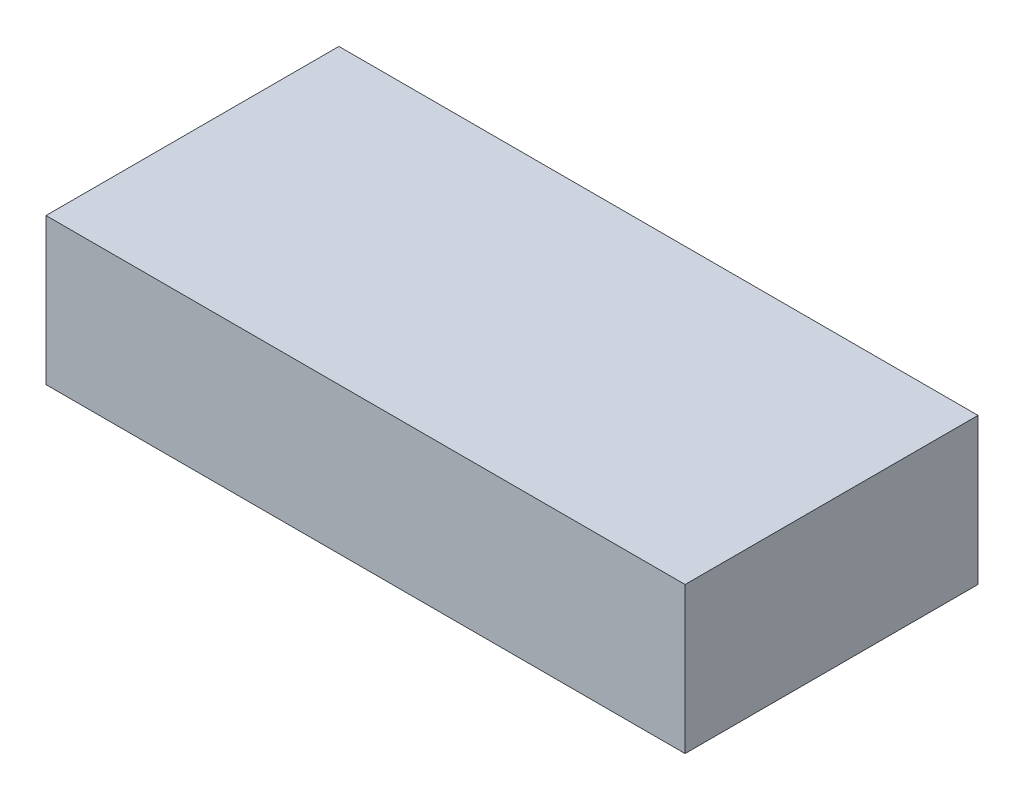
from build123d import *

# Parameters (mm, degrees)
ESQUISSE1_W        = 240
ESQUISSE1_H        = 55
BOSS_EXTRU_1_DEPTH = 110


with BuildPart() as part:
    # Esquisse1 → Boss.-Extru.1 (new body)
    with BuildSketch(Plane.XY):
        with Locations((120, 27.5)):
            Rectangle(ESQUISSE1_W, ESQUISSE1_H)
    extrude(amount=BOSS_EXTRU_1_DEPTH)


solid = part.part
